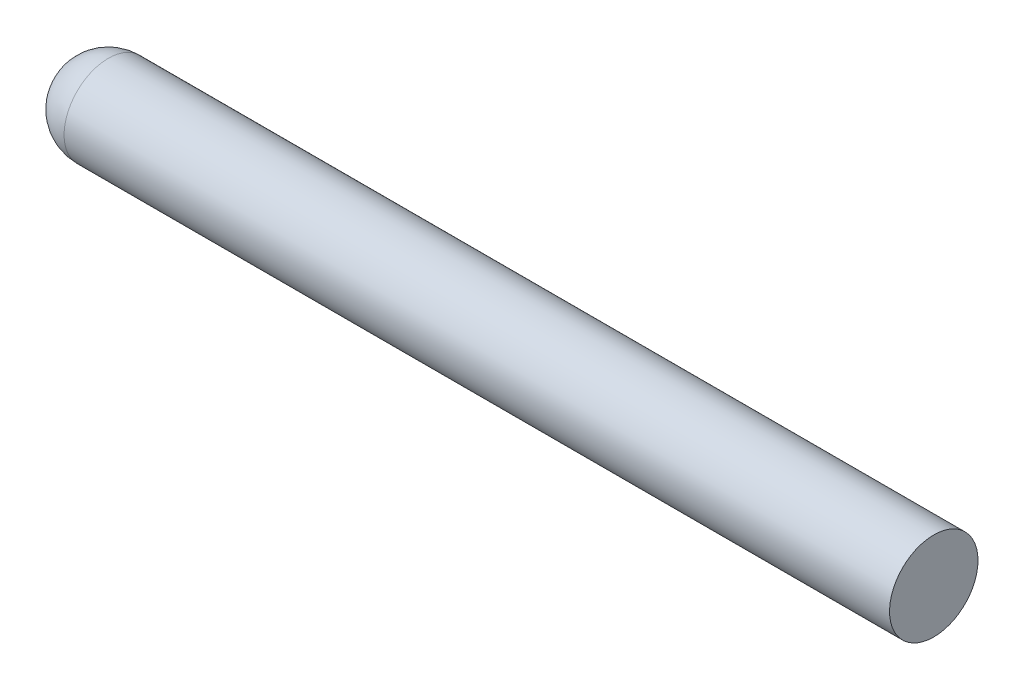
ISO-10303-21;
HEADER;
FILE_DESCRIPTION(('STEP AP214'),'2;1');
FILE_NAME('part.step','',(''),(''),'','','');
FILE_SCHEMA(('AUTOMOTIVE_DESIGN { 1 0 10303 214 1 1 1 1 }'));
ENDSEC;
DATA;
#1=APPLICATION_CONTEXT('core data for automotive mechanical design processes');
#2=APPLICATION_PROTOCOL_DEFINITION('international standard','automotive_design',2000,#1);
#3=PRODUCT_CONTEXT('',#1,'mechanical');
#4=PRODUCT('Part','Part','',(#3));
#5=PRODUCT_RELATED_PRODUCT_CATEGORY('part','',(#4));
#6=PRODUCT_DEFINITION_FORMATION('','',#4);
#7=PRODUCT_DEFINITION_CONTEXT('part definition',#1,'design');
#8=PRODUCT_DEFINITION('design','',#6,#7);
#9=PRODUCT_DEFINITION_SHAPE('','',#8);
#10=(LENGTH_UNIT() NAMED_UNIT(*) SI_UNIT(.MILLI.,.METRE.));
#11=(NAMED_UNIT(*) PLANE_ANGLE_UNIT() SI_UNIT($,.RADIAN.));
#12=(NAMED_UNIT(*) SI_UNIT($,.STERADIAN.) SOLID_ANGLE_UNIT());
#13=UNCERTAINTY_MEASURE_WITH_UNIT(LENGTH_MEASURE(1.E-05),#10,'distance_accuracy_value','');
#14=(GEOMETRIC_REPRESENTATION_CONTEXT(3) GLOBAL_UNCERTAINTY_ASSIGNED_CONTEXT((#13)) GLOBAL_UNIT_ASSIGNED_CONTEXT((#10,
#11,#12)) REPRESENTATION_CONTEXT('',''));
#15=CARTESIAN_POINT('',(0.,0.,0.));
#16=DIRECTION('',(0.,0.,1.));
#17=DIRECTION('',(1.,0.,0.));
#18=AXIS2_PLACEMENT_3D('',#15,#16,#17);
#19=CARTESIAN_POINT('',(-29.3525,19.9,0.));
#20=DIRECTION('',(1.,0.,0.));
#21=DIRECTION('',(0.,1.,0.));
#22=AXIS2_PLACEMENT_3D('',#19,#20,#21);
#23=CYLINDRICAL_SURFACE('',#22,1.4925);
#24=CARTESIAN_POINT('',(-27.86,19.9,0.));
#25=DIRECTION('',(1.,0.,0.));
#26=DIRECTION('',(0.,0.,-1.));
#27=AXIS2_PLACEMENT_3D('',#24,#25,#26);
#28=CIRCLE('',#27,1.4925);
#29=CARTESIAN_POINT('',(-27.86,19.9,-1.49249999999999));
#30=VERTEX_POINT('',#29);
#31=EDGE_CURVE('E10',#30,#30,#28,.T.);
#32=ORIENTED_EDGE('',*,*,#31,.T.);
#33=EDGE_LOOP('',(#32));
#34=FACE_BOUND('',#33,.T.);
#35=CARTESIAN_POINT('',(0.,19.9,0.));
#36=DIRECTION('',(-1.,0.,0.));
#37=DIRECTION('',(0.,-1.,0.));
#38=AXIS2_PLACEMENT_3D('',#35,#36,#37);
#39=CIRCLE('',#38,1.4925);
#40=CARTESIAN_POINT('',(0.,18.4075,0.));
#41=VERTEX_POINT('',#40);
#42=EDGE_CURVE('E21',#41,#41,#39,.T.);
#43=ORIENTED_EDGE('',*,*,#42,.T.);
#44=EDGE_LOOP('',(#43));
#45=FACE_BOUND('',#44,.T.);
#46=ADVANCED_FACE('F14',(#34,#45),#23,.T.);
#47=CARTESIAN_POINT('',(0.,19.9,0.));
#48=DIRECTION('',(-1.,0.,0.));
#49=DIRECTION('',(0.,0.,-1.));
#50=AXIS2_PLACEMENT_3D('',#47,#48,#49);
#51=PLANE('',#50);
#52=ORIENTED_EDGE('',*,*,#42,.F.);
#53=EDGE_LOOP('',(#52));
#54=FACE_BOUND('',#53,.T.);
#55=ADVANCED_FACE('F47',(#54),#51,.F.);
#56=CARTESIAN_POINT('',(-27.86,19.9,0.));
#57=DIRECTION('',(0.,0.,1.));
#58=DIRECTION('',(1.,0.,0.));
#59=AXIS2_PLACEMENT_3D('',#56,#57,#58);
#60=SPHERICAL_SURFACE('',#59,1.4925);
#61=CARTESIAN_POINT('',(-27.86,19.9,0.));
#62=DIRECTION('',(1.,0.,0.));
#63=DIRECTION('',(0.,0.,-1.));
#64=AXIS2_PLACEMENT_3D('',#61,#62,#63);
#65=SPHERICAL_SURFACE('',#64,1.4925);
#66=ORIENTED_EDGE('',*,*,#31,.F.);
#67=EDGE_LOOP('',(#66));
#68=FACE_BOUND('',#67,.T.);
#69=ADVANCED_FACE('F49',(#68),#65,.T.);
#70=CLOSED_SHELL('',(#46,#55,#69));
#71=MANIFOLD_SOLID_BREP('B1',#70);
#72=ADVANCED_BREP_SHAPE_REPRESENTATION('',(#18,#71),#14);
#73=SHAPE_DEFINITION_REPRESENTATION(#9,#72);
ENDSEC;
END-ISO-10303-21;
